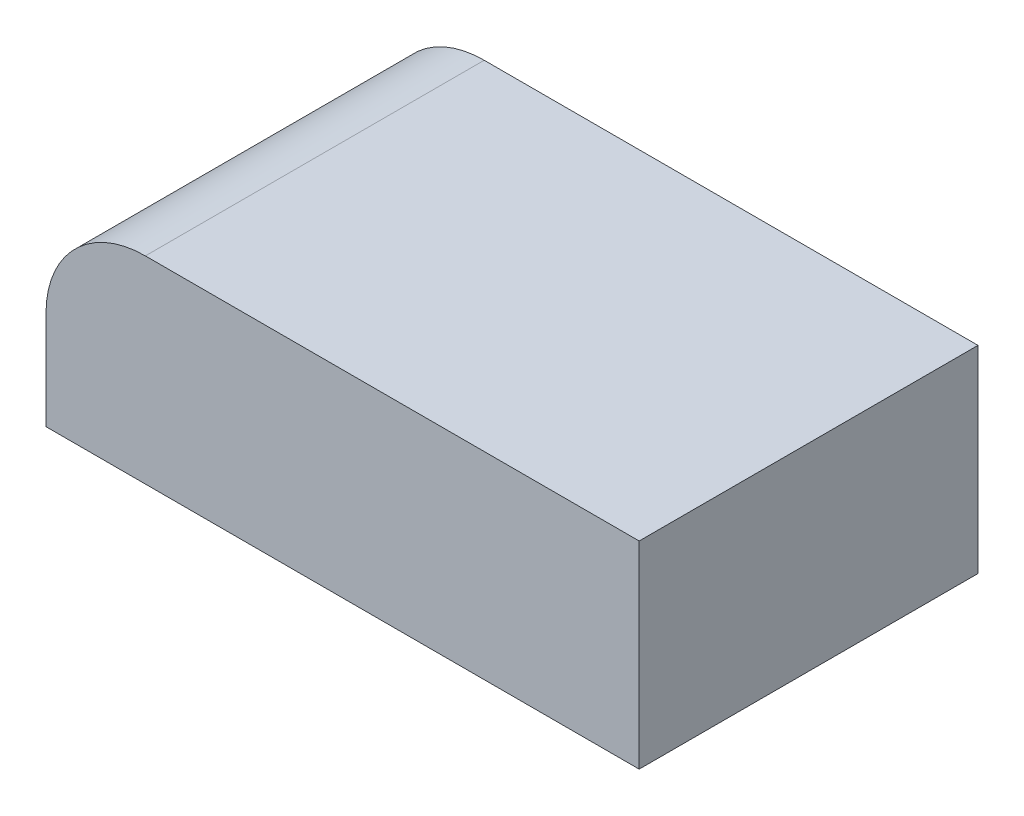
from build123d import *

# Parameters (mm, degrees)
LINEAR_AUSTRAGEN1_DEPTH = 55


with BuildPart() as part:
    # Skizze1 → Linear austragen1 (new body)
    with BuildSketch(Plane.XY):
        with BuildLine():
            Line((0, 0), (0, 15.94627778))
            ThreePointArc((0, 15.94627778), (4.724285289, 27.351711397), (16.129718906, 32.075996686))
            Line((16.129718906, 32.075996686), (96.282150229, 32.075996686))
            Line((96.282150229, 32.075996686), (96.282150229, 0))
            Line((96.282150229, 0), (0, 0))
        make_face()
    extrude(amount=-LINEAR_AUSTRAGEN1_DEPTH)


solid = part.part
